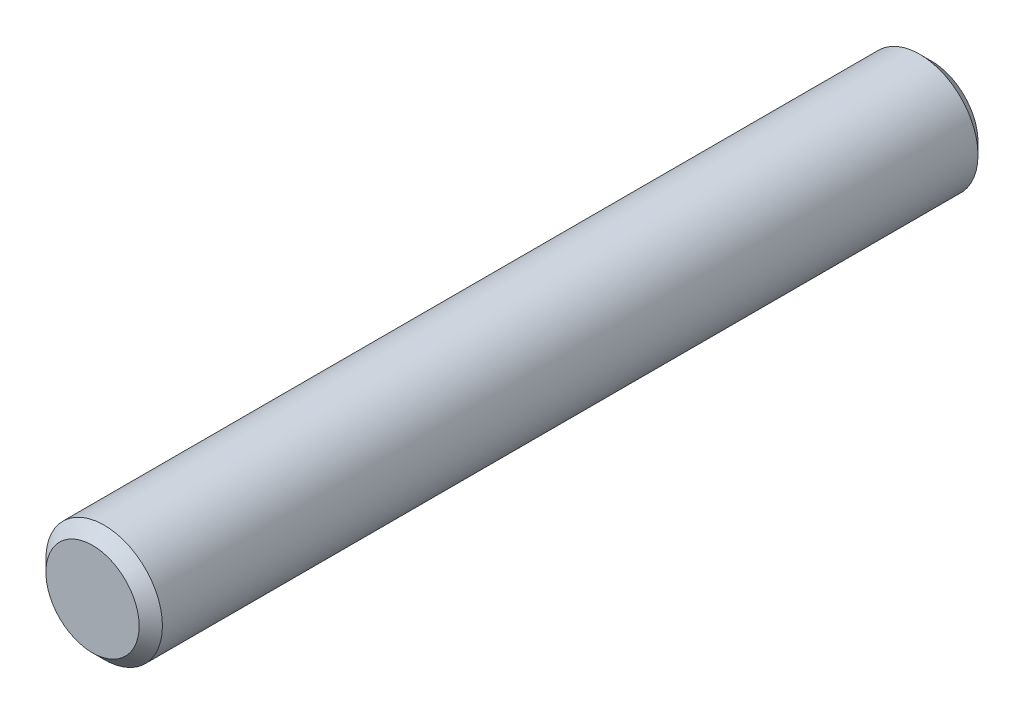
from build123d import *

# Parameters (mm, degrees)
SKETCH_1_R      = 5
EXTRUDE_1_DEPTH = 72
CHAMFER_1_SIZE  = 1


with BuildPart() as part:
    # Sketch 1 → Extrude 1 (new body)
    with BuildSketch(Plane.XY):
        with Locations((-11.808932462, 14.628976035)):
            Circle(SKETCH_1_R)
    extrude(amount=EXTRUDE_1_DEPTH)

    # Chamfer 1
    chamfer_1_edges = [part.edges().sort_by_distance(p)[0] for p in [
        (-16.808932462, 14.628976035, 0),
        (-16.808932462, 14.628976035, 72),
    ]]
    chamfer(chamfer_1_edges, length=CHAMFER_1_SIZE)


solid = part.part
